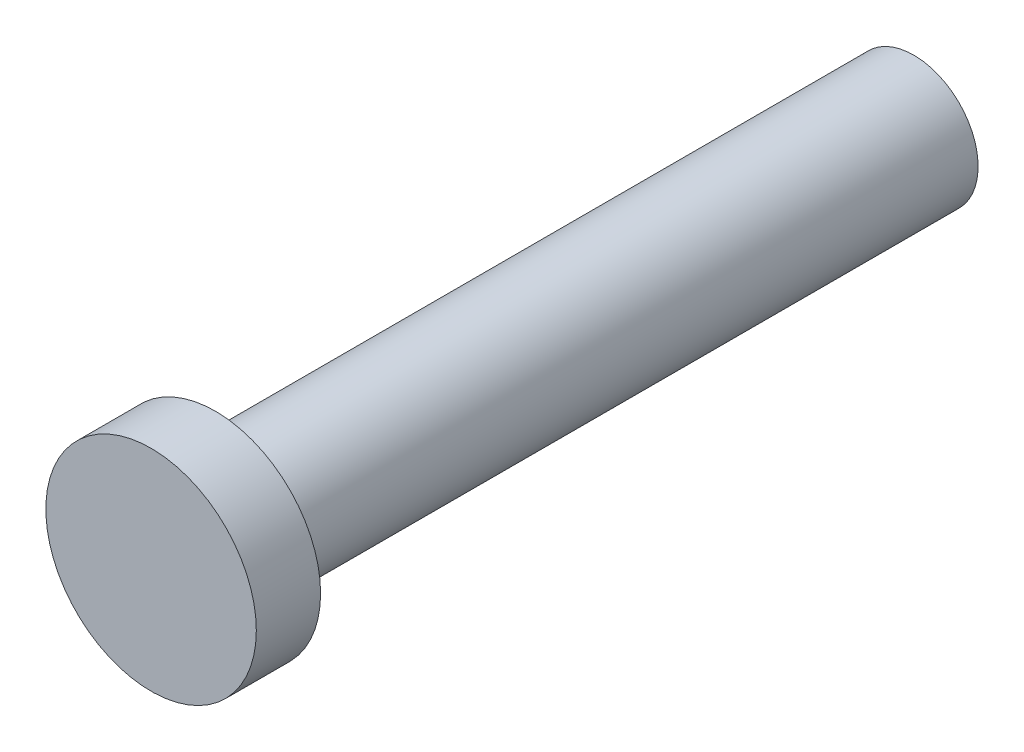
ISO-10303-21;
HEADER;
FILE_DESCRIPTION(('STEP AP214'),'2;1');
FILE_NAME('part.step','',(''),(''),'','','');
FILE_SCHEMA(('AUTOMOTIVE_DESIGN { 1 0 10303 214 1 1 1 1 }'));
ENDSEC;
DATA;
#1=APPLICATION_CONTEXT('core data for automotive mechanical design processes');
#2=APPLICATION_PROTOCOL_DEFINITION('international standard','automotive_design',2000,#1);
#3=PRODUCT_CONTEXT('',#1,'mechanical');
#4=PRODUCT('Part','Part','',(#3));
#5=PRODUCT_RELATED_PRODUCT_CATEGORY('part','',(#4));
#6=PRODUCT_DEFINITION_FORMATION('','',#4);
#7=PRODUCT_DEFINITION_CONTEXT('part definition',#1,'design');
#8=PRODUCT_DEFINITION('design','',#6,#7);
#9=PRODUCT_DEFINITION_SHAPE('','',#8);
#10=(LENGTH_UNIT() NAMED_UNIT(*) SI_UNIT(.MILLI.,.METRE.));
#11=(NAMED_UNIT(*) PLANE_ANGLE_UNIT() SI_UNIT($,.RADIAN.));
#12=(NAMED_UNIT(*) SI_UNIT($,.STERADIAN.) SOLID_ANGLE_UNIT());
#13=UNCERTAINTY_MEASURE_WITH_UNIT(LENGTH_MEASURE(1.E-05),#10,'distance_accuracy_value','');
#14=(GEOMETRIC_REPRESENTATION_CONTEXT(3) GLOBAL_UNCERTAINTY_ASSIGNED_CONTEXT((#13)) GLOBAL_UNIT_ASSIGNED_CONTEXT((#10,
#11,#12)) REPRESENTATION_CONTEXT('',''));
#15=CARTESIAN_POINT('',(0.,0.,0.));
#16=DIRECTION('',(0.,0.,1.));
#17=DIRECTION('',(1.,0.,0.));
#18=AXIS2_PLACEMENT_3D('',#15,#16,#17);
#19=CARTESIAN_POINT('',(0.,0.,22.5552));
#20=DIRECTION('',(0.,0.,-1.));
#21=DIRECTION('',(-1.,0.,0.));
#22=AXIS2_PLACEMENT_3D('',#19,#20,#21);
#23=CYLINDRICAL_SURFACE('',#22,2.8702);
#24=CARTESIAN_POINT('',(0.,0.,19.05));
#25=DIRECTION('',(0.,0.,1.));
#26=DIRECTION('',(1.,0.,0.));
#27=AXIS2_PLACEMENT_3D('',#24,#25,#26);
#28=CIRCLE('',#27,2.8702);
#29=CARTESIAN_POINT('',(2.8702,0.,19.05));
#30=VERTEX_POINT('',#29);
#31=EDGE_CURVE('E50',#30,#30,#28,.T.);
#32=ORIENTED_EDGE('',*,*,#31,.T.);
#33=EDGE_LOOP('',(#32));
#34=FACE_BOUND('',#33,.T.);
#35=CARTESIAN_POINT('',(0.,0.,20.8026000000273));
#36=DIRECTION('',(0.,0.,1.));
#37=DIRECTION('',(1.,0.,0.));
#38=AXIS2_PLACEMENT_3D('',#35,#36,#37);
#39=CIRCLE('',#38,2.8702);
#40=CARTESIAN_POINT('',(2.8702,0.,20.8026000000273));
#41=VERTEX_POINT('',#40);
#42=EDGE_CURVE('E37',#41,#41,#39,.T.);
#43=ORIENTED_EDGE('',*,*,#42,.F.);
#44=EDGE_LOOP('',(#43));
#45=FACE_BOUND('',#44,.T.);
#46=ADVANCED_FACE('F33',(#34,#45),#23,.T.);
#47=CARTESIAN_POINT('',(0.,0.,19.05));
#48=DIRECTION('',(0.,0.,-1.));
#49=DIRECTION('',(-1.,0.,0.));
#50=AXIS2_PLACEMENT_3D('',#47,#48,#49);
#51=CYLINDRICAL_SURFACE('',#50,1.7526);
#52=CARTESIAN_POINT('',(0.,0.,18.796));
#53=DIRECTION('',(0.,0.,1.));
#54=DIRECTION('',(1.,0.,0.));
#55=AXIS2_PLACEMENT_3D('',#52,#53,#54);
#56=CIRCLE('',#55,1.7526);
#57=CARTESIAN_POINT('',(-1.7526,0.,18.796));
#58=VERTEX_POINT('',#57);
#59=EDGE_CURVE('E10',#58,#58,#56,.F.);
#60=CARTESIAN_POINT('',(0.,0.,0.));
#61=DIRECTION('',(0.,0.,1.));
#62=DIRECTION('',(1.,0.,0.));
#63=AXIS2_PLACEMENT_3D('',#60,#61,#62);
#64=CIRCLE('',#63,1.7526);
#65=CARTESIAN_POINT('',(-1.7526,0.,0.));
#66=VERTEX_POINT('',#65);
#67=EDGE_CURVE('E45',#66,#66,#64,.T.);
#68=CARTESIAN_POINT('',(-1.7526,0.,18.796));
#69=CARTESIAN_POINT('',(-1.7526,0.,18.6002083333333));
#70=CARTESIAN_POINT('',(-1.7526,0.,18.4044166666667));
#71=CARTESIAN_POINT('',(-1.7526,0.,18.0128333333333));
#72=CARTESIAN_POINT('',(-1.7526,0.,17.8170416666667));
#73=CARTESIAN_POINT('',(-1.7526,0.,17.4254583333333));
#74=CARTESIAN_POINT('',(-1.7526,0.,17.2296666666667));
#75=CARTESIAN_POINT('',(-1.7526,0.,16.8380833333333));
#76=CARTESIAN_POINT('',(-1.7526,0.,16.6422916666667));
#77=CARTESIAN_POINT('',(-1.7526,0.,16.2507083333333));
#78=CARTESIAN_POINT('',(-1.7526,0.,16.0549166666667));
#79=CARTESIAN_POINT('',(-1.7526,0.,15.6633333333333));
#80=CARTESIAN_POINT('',(-1.7526,0.,15.4675416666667));
#81=CARTESIAN_POINT('',(-1.7526,0.,15.0759583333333));
#82=CARTESIAN_POINT('',(-1.7526,0.,14.8801666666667));
#83=CARTESIAN_POINT('',(-1.7526,0.,14.4885833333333));
#84=CARTESIAN_POINT('',(-1.7526,0.,14.2927916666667));
#85=CARTESIAN_POINT('',(-1.7526,0.,13.9012083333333));
#86=CARTESIAN_POINT('',(-1.7526,0.,13.7054166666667));
#87=CARTESIAN_POINT('',(-1.7526,0.,13.3138333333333));
#88=CARTESIAN_POINT('',(-1.7526,0.,13.1180416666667));
#89=CARTESIAN_POINT('',(-1.7526,0.,12.7264583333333));
#90=CARTESIAN_POINT('',(-1.7526,0.,12.5306666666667));
#91=CARTESIAN_POINT('',(-1.7526,0.,12.1390833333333));
#92=CARTESIAN_POINT('',(-1.7526,0.,11.9432916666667));
#93=CARTESIAN_POINT('',(-1.7526,0.,11.5517083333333));
#94=CARTESIAN_POINT('',(-1.7526,0.,11.3559166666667));
#95=CARTESIAN_POINT('',(-1.7526,0.,10.9643333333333));
#96=CARTESIAN_POINT('',(-1.7526,0.,10.7685416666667));
#97=CARTESIAN_POINT('',(-1.7526,0.,10.3769583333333));
#98=CARTESIAN_POINT('',(-1.7526,0.,10.1811666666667));
#99=CARTESIAN_POINT('',(-1.7526,0.,9.78958333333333));
#100=CARTESIAN_POINT('',(-1.7526,0.,9.59379166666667));
#101=CARTESIAN_POINT('',(-1.7526,0.,9.20220833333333));
#102=CARTESIAN_POINT('',(-1.7526,0.,9.00641666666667));
#103=CARTESIAN_POINT('',(-1.7526,0.,8.61483333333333));
#104=CARTESIAN_POINT('',(-1.7526,0.,8.41904166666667));
#105=CARTESIAN_POINT('',(-1.7526,0.,8.02745833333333));
#106=CARTESIAN_POINT('',(-1.7526,0.,7.83166666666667));
#107=CARTESIAN_POINT('',(-1.7526,0.,7.44008333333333));
#108=CARTESIAN_POINT('',(-1.7526,0.,7.24429166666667));
#109=CARTESIAN_POINT('',(-1.7526,0.,6.85270833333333));
#110=CARTESIAN_POINT('',(-1.7526,0.,6.65691666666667));
#111=CARTESIAN_POINT('',(-1.7526,0.,6.26533333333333));
#112=CARTESIAN_POINT('',(-1.7526,0.,6.06954166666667));
#113=CARTESIAN_POINT('',(-1.7526,0.,5.67795833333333));
#114=CARTESIAN_POINT('',(-1.7526,0.,5.48216666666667));
#115=CARTESIAN_POINT('',(-1.7526,0.,5.09058333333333));
#116=CARTESIAN_POINT('',(-1.7526,0.,4.89479166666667));
#117=CARTESIAN_POINT('',(-1.7526,0.,4.50320833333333));
#118=CARTESIAN_POINT('',(-1.7526,0.,4.30741666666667));
#119=CARTESIAN_POINT('',(-1.7526,0.,3.91583333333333));
#120=CARTESIAN_POINT('',(-1.7526,0.,3.72004166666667));
#121=CARTESIAN_POINT('',(-1.7526,0.,3.32845833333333));
#122=CARTESIAN_POINT('',(-1.7526,0.,3.13266666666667));
#123=CARTESIAN_POINT('',(-1.7526,0.,2.74108333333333));
#124=CARTESIAN_POINT('',(-1.7526,0.,2.54529166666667));
#125=CARTESIAN_POINT('',(-1.7526,0.,2.15370833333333));
#126=CARTESIAN_POINT('',(-1.7526,0.,1.95791666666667));
#127=CARTESIAN_POINT('',(-1.7526,0.,1.56633333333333));
#128=CARTESIAN_POINT('',(-1.7526,0.,1.37054166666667));
#129=CARTESIAN_POINT('',(-1.7526,0.,0.978958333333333));
#130=CARTESIAN_POINT('',(-1.7526,0.,0.783166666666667));
#131=CARTESIAN_POINT('',(-1.7526,0.,0.391583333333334));
#132=CARTESIAN_POINT('',(-1.7526,0.,0.195791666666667));
#133=CARTESIAN_POINT('',(-1.7526,0.,0.));
#134=B_SPLINE_CURVE_WITH_KNOTS('',3,(#68,#69,#70,#71,#72,#73,#74,#75,#76,#77,#78,#79,#80,#81,
#82,#83,#84,#85,#86,#87,#88,#89,#90,#91,#92,#93,#94,#95,#96,#97,#98,#99,#100,#101,#102,#103,
#104,#105,#106,#107,#108,#109,#110,#111,#112,#113,#114,#115,#116,#117,#118,#119,#120,#121,#122,
#123,#124,#125,#126,#127,#128,#129,#130,#131,#132,#133),.UNSPECIFIED.,.F.,.F.,(4,2,2,2,2,2,2,2,
2,2,2,2,2,2,2,2,2,2,2,2,2,2,2,2,2,2,2,2,2,2,2,2,4),(0.,0.587374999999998,1.17475,1.762125,
2.3495,2.936875,3.52425,4.111625,4.699,5.286375,5.87375,6.461125,7.0485,7.635875,8.22325,
8.810625,9.398,9.985375,10.57275,11.160125,11.7475,12.334875,12.92225,13.509625,14.097,
14.684375,15.27175,15.859125,16.4465,17.033875,17.62125,18.208625,18.796),.UNSPECIFIED.);
#135=EDGE_CURVE('BSEAM60',#58,#66,#134,.T.);
#136=ORIENTED_EDGE('',*,*,#59,.T.);
#137=ORIENTED_EDGE('',*,*,#67,.T.);
#138=ORIENTED_EDGE('',*,*,#135,.T.);
#139=ORIENTED_EDGE('',*,*,#135,.F.);
#140=EDGE_LOOP('',(#136,#138,#137,#139));
#141=FACE_BOUND('',#140,.T.);
#142=ADVANCED_FACE('F60',(#141),#51,.T.);
#143=CARTESIAN_POINT('',(0.,0.,0.));
#144=DIRECTION('',(0.,0.,1.));
#145=DIRECTION('',(1.,0.,0.));
#146=AXIS2_PLACEMENT_3D('',#143,#144,#145);
#147=PLANE('',#146);
#148=ORIENTED_EDGE('',*,*,#67,.F.);
#149=EDGE_LOOP('',(#148));
#150=FACE_BOUND('',#149,.T.);
#151=ADVANCED_FACE('F65',(#150),#147,.F.);
#152=CARTESIAN_POINT('',(0.,0.,19.05));
#153=DIRECTION('',(0.,0.,1.));
#154=DIRECTION('',(1.,0.,0.));
#155=AXIS2_PLACEMENT_3D('',#152,#153,#154);
#156=PLANE('',#155);
#157=CARTESIAN_POINT('',(0.,0.,19.05));
#158=DIRECTION('',(0.,0.,1.));
#159=DIRECTION('',(1.,0.,0.));
#160=AXIS2_PLACEMENT_3D('',#157,#158,#159);
#161=CIRCLE('',#160,2.0066);
#162=CARTESIAN_POINT('',(2.0066,0.,19.05));
#163=VERTEX_POINT('',#162);
#164=EDGE_CURVE('E41',#163,#163,#161,.T.);
#165=ORIENTED_EDGE('',*,*,#164,.T.);
#166=EDGE_LOOP('',(#165));
#167=FACE_BOUND('',#166,.T.);
#168=ORIENTED_EDGE('',*,*,#31,.F.);
#169=EDGE_LOOP('',(#168));
#170=FACE_BOUND('',#169,.T.);
#171=ADVANCED_FACE('F68',(#167,#170),#156,.F.);
#172=CARTESIAN_POINT('',(0.,0.,18.796));
#173=DIRECTION('',(0.,0.,1.));
#174=DIRECTION('',(1.,0.,0.));
#175=AXIS2_PLACEMENT_3D('',#172,#173,#174);
#176=TOROIDAL_SURFACE('',#175,2.0066,0.254);
#177=ORIENTED_EDGE('',*,*,#59,.F.);
#178=EDGE_LOOP('',(#177));
#179=FACE_BOUND('',#178,.T.);
#180=ORIENTED_EDGE('',*,*,#164,.F.);
#181=EDGE_LOOP('',(#180));
#182=FACE_BOUND('',#181,.T.);
#183=ADVANCED_FACE('F35',(#179,#182),#176,.F.);
#184=CARTESIAN_POINT('',(-3.175,1.83308710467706,20.8026000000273));
#185=DIRECTION('',(0.,0.,1.));
#186=DIRECTION('',(1.,0.,0.));
#187=AXIS2_PLACEMENT_3D('',#184,#185,#186);
#188=PLANE('',#187);
#189=ORIENTED_EDGE('',*,*,#42,.T.);
#190=EDGE_LOOP('',(#189));
#191=FACE_BOUND('',#190,.T.);
#192=ADVANCED_FACE('F57',(#191),#188,.T.);
#193=CLOSED_SHELL('',(#46,#142,#151,#171,#183,#192));
#194=MANIFOLD_SOLID_BREP('B2',#193);
#195=ADVANCED_BREP_SHAPE_REPRESENTATION('',(#18,#194),#14);
#196=SHAPE_DEFINITION_REPRESENTATION(#9,#195);
ENDSEC;
END-ISO-10303-21;
